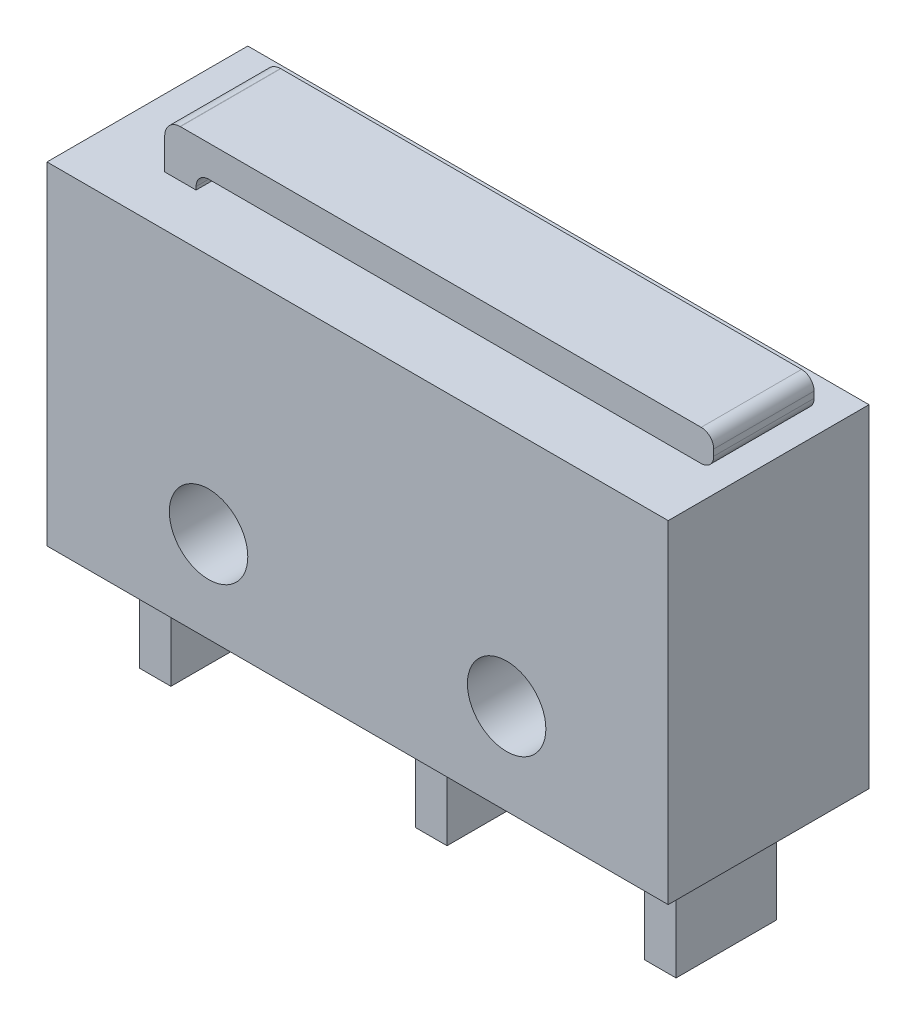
ISO-10303-21;
HEADER;
FILE_DESCRIPTION(('STEP AP214'),'2;1');
FILE_NAME('part.step','',(''),(''),'','','');
FILE_SCHEMA(('AUTOMOTIVE_DESIGN { 1 0 10303 214 1 1 1 1 }'));
ENDSEC;
DATA;
#1=APPLICATION_CONTEXT('core data for automotive mechanical design processes');
#2=APPLICATION_PROTOCOL_DEFINITION('international standard','automotive_design',2000,#1);
#3=PRODUCT_CONTEXT('',#1,'mechanical');
#4=PRODUCT('Part','Part','',(#3));
#5=PRODUCT_RELATED_PRODUCT_CATEGORY('part','',(#4));
#6=PRODUCT_DEFINITION_FORMATION('','',#4);
#7=PRODUCT_DEFINITION_CONTEXT('part definition',#1,'design');
#8=PRODUCT_DEFINITION('design','',#6,#7);
#9=PRODUCT_DEFINITION_SHAPE('','',#8);
#10=(LENGTH_UNIT() NAMED_UNIT(*) SI_UNIT(.MILLI.,.METRE.));
#11=(NAMED_UNIT(*) PLANE_ANGLE_UNIT() SI_UNIT($,.RADIAN.));
#12=(NAMED_UNIT(*) SI_UNIT($,.STERADIAN.) SOLID_ANGLE_UNIT());
#13=UNCERTAINTY_MEASURE_WITH_UNIT(LENGTH_MEASURE(1.E-05),#10,'distance_accuracy_value','');
#14=(GEOMETRIC_REPRESENTATION_CONTEXT(3) GLOBAL_UNCERTAINTY_ASSIGNED_CONTEXT((#13)) GLOBAL_UNIT_ASSIGNED_CONTEXT((#10,
#11,#12)) REPRESENTATION_CONTEXT('',''));
#15=CARTESIAN_POINT('',(0.,0.,0.));
#16=DIRECTION('',(0.,0.,1.));
#17=DIRECTION('',(1.,0.,0.));
#18=AXIS2_PLACEMENT_3D('',#15,#16,#17);
#19=CARTESIAN_POINT('',(-9.9,10.6,-3.2));
#20=DIRECTION('',(0.,0.,1.));
#21=DIRECTION('',(1.,0.,0.));
#22=AXIS2_PLACEMENT_3D('',#19,#20,#21);
#23=PLANE('',#22);
#24=DIRECTION('',(-1.,0.,0.));
#25=VECTOR('',#24,1.);
#26=CARTESIAN_POINT('',(-9.9,0.,-3.2));
#27=LINE('',#26,#25);
#28=CARTESIAN_POINT('',(9.90000000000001,0.,-3.2));
#29=VERTEX_POINT('',#28);
#30=CARTESIAN_POINT('',(-9.9,0.,-3.2));
#31=VERTEX_POINT('',#30);
#32=EDGE_CURVE('E358',#29,#31,#27,.T.);
#33=ORIENTED_EDGE('',*,*,#32,.T.);
#34=DIRECTION('',(0.,-1.,0.));
#35=VECTOR('',#34,1.);
#36=CARTESIAN_POINT('',(-9.9,10.6,-3.2));
#37=LINE('',#36,#35);
#38=CARTESIAN_POINT('',(-9.9,10.6,-3.2));
#39=VERTEX_POINT('',#38);
#40=EDGE_CURVE('E44',#39,#31,#37,.T.);
#41=ORIENTED_EDGE('',*,*,#40,.F.);
#42=DIRECTION('',(-1.,0.,0.));
#43=VECTOR('',#42,1.);
#44=CARTESIAN_POINT('',(-9.9,10.6,-3.2));
#45=LINE('',#44,#43);
#46=CARTESIAN_POINT('',(9.90000000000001,10.6,-3.2));
#47=VERTEX_POINT('',#46);
#48=EDGE_CURVE('E348',#47,#39,#45,.T.);
#49=ORIENTED_EDGE('',*,*,#48,.F.);
#50=DIRECTION('',(0.,-1.,0.));
#51=VECTOR('',#50,1.);
#52=CARTESIAN_POINT('',(9.90000000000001,10.6,-3.2));
#53=LINE('',#52,#51);
#54=EDGE_CURVE('E11',#47,#29,#53,.T.);
#55=ORIENTED_EDGE('',*,*,#54,.T.);
#56=EDGE_LOOP('',(#33,#41,#49,#55));
#57=FACE_BOUND('',#56,.T.);
#58=CARTESIAN_POINT('',(4.75,2.9,-3.2));
#59=DIRECTION('',(0.,0.,1.));
#60=DIRECTION('',(1.,0.,0.));
#61=AXIS2_PLACEMENT_3D('',#58,#59,#60);
#62=CIRCLE('',#61,1.25);
#63=CARTESIAN_POINT('',(6.,2.9,-3.2));
#64=VERTEX_POINT('',#63);
#65=EDGE_CURVE('E241',#64,#64,#62,.F.);
#66=ORIENTED_EDGE('',*,*,#65,.F.);
#67=EDGE_LOOP('',(#66));
#68=FACE_BOUND('',#67,.T.);
#69=CARTESIAN_POINT('',(-4.75,2.9,-3.2));
#70=DIRECTION('',(0.,0.,1.));
#71=DIRECTION('',(1.,0.,0.));
#72=AXIS2_PLACEMENT_3D('',#69,#70,#71);
#73=CIRCLE('',#72,1.25);
#74=CARTESIAN_POINT('',(-3.5,2.9,-3.2));
#75=VERTEX_POINT('',#74);
#76=EDGE_CURVE('E248',#75,#75,#73,.T.);
#77=ORIENTED_EDGE('',*,*,#76,.T.);
#78=EDGE_LOOP('',(#77));
#79=FACE_BOUND('',#78,.T.);
#80=ADVANCED_FACE('F35',(#57,#68,#79),#23,.F.);
#81=CARTESIAN_POINT('',(-9.9,10.6,3.2));
#82=DIRECTION('',(0.,0.,-1.));
#83=DIRECTION('',(-1.,0.,0.));
#84=AXIS2_PLACEMENT_3D('',#81,#82,#83);
#85=PLANE('',#84);
#86=DIRECTION('',(1.,0.,0.));
#87=VECTOR('',#86,1.);
#88=CARTESIAN_POINT('',(-9.9,0.,3.2));
#89=LINE('',#88,#87);
#90=CARTESIAN_POINT('',(-9.9,0.,3.2));
#91=VERTEX_POINT('',#90);
#92=CARTESIAN_POINT('',(9.90000000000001,0.,3.2));
#93=VERTEX_POINT('',#92);
#94=EDGE_CURVE('E349',#91,#93,#89,.T.);
#95=ORIENTED_EDGE('',*,*,#94,.T.);
#96=DIRECTION('',(0.,-1.,0.));
#97=VECTOR('',#96,1.);
#98=CARTESIAN_POINT('',(9.90000000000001,10.6,3.2));
#99=LINE('',#98,#97);
#100=CARTESIAN_POINT('',(9.90000000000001,10.6,3.2));
#101=VERTEX_POINT('',#100);
#102=EDGE_CURVE('E355',#101,#93,#99,.T.);
#103=ORIENTED_EDGE('',*,*,#102,.F.);
#104=DIRECTION('',(1.,0.,0.));
#105=VECTOR('',#104,1.);
#106=CARTESIAN_POINT('',(-9.9,10.6,3.2));
#107=LINE('',#106,#105);
#108=CARTESIAN_POINT('',(-9.9,10.6,3.2));
#109=VERTEX_POINT('',#108);
#110=EDGE_CURVE('E353',#109,#101,#107,.T.);
#111=ORIENTED_EDGE('',*,*,#110,.F.);
#112=DIRECTION('',(0.,-1.,0.));
#113=VECTOR('',#112,1.);
#114=CARTESIAN_POINT('',(-9.9,10.6,3.2));
#115=LINE('',#114,#113);
#116=EDGE_CURVE('E365',#109,#91,#115,.T.);
#117=ORIENTED_EDGE('',*,*,#116,.T.);
#118=EDGE_LOOP('',(#95,#103,#111,#117));
#119=FACE_BOUND('',#118,.T.);
#120=CARTESIAN_POINT('',(4.75,2.9,3.2));
#121=DIRECTION('',(0.,0.,-1.));
#122=DIRECTION('',(-1.,0.,0.));
#123=AXIS2_PLACEMENT_3D('',#120,#121,#122);
#124=CIRCLE('',#123,1.25);
#125=CARTESIAN_POINT('',(3.5,2.9,3.2));
#126=VERTEX_POINT('',#125);
#127=EDGE_CURVE('E238',#126,#126,#124,.F.);
#128=ORIENTED_EDGE('',*,*,#127,.F.);
#129=EDGE_LOOP('',(#128));
#130=FACE_BOUND('',#129,.T.);
#131=CARTESIAN_POINT('',(-4.75,2.9,3.2));
#132=DIRECTION('',(0.,0.,-1.));
#133=DIRECTION('',(-1.,0.,0.));
#134=AXIS2_PLACEMENT_3D('',#131,#132,#133);
#135=CIRCLE('',#134,1.25);
#136=CARTESIAN_POINT('',(-6.,2.9,3.2));
#137=VERTEX_POINT('',#136);
#138=EDGE_CURVE('E39',#137,#137,#135,.T.);
#139=ORIENTED_EDGE('',*,*,#138,.T.);
#140=EDGE_LOOP('',(#139));
#141=FACE_BOUND('',#140,.T.);
#142=ADVANCED_FACE('F382',(#119,#130,#141),#85,.F.);
#143=CARTESIAN_POINT('',(9.90000000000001,10.6,-3.2));
#144=DIRECTION('',(-1.,0.,0.));
#145=DIRECTION('',(0.,0.,1.));
#146=AXIS2_PLACEMENT_3D('',#143,#144,#145);
#147=PLANE('',#146);
#148=DIRECTION('',(0.,0.,-1.));
#149=VECTOR('',#148,1.);
#150=CARTESIAN_POINT('',(9.90000000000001,0.,-3.2));
#151=LINE('',#150,#149);
#152=EDGE_CURVE('E344',#93,#29,#151,.T.);
#153=ORIENTED_EDGE('',*,*,#152,.T.);
#154=ORIENTED_EDGE('',*,*,#54,.F.);
#155=DIRECTION('',(0.,0.,-1.));
#156=VECTOR('',#155,1.);
#157=CARTESIAN_POINT('',(9.90000000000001,10.6,-3.2));
#158=LINE('',#157,#156);
#159=EDGE_CURVE('E345',#101,#47,#158,.T.);
#160=ORIENTED_EDGE('',*,*,#159,.F.);
#161=ORIENTED_EDGE('',*,*,#102,.T.);
#162=EDGE_LOOP('',(#153,#154,#160,#161));
#163=FACE_BOUND('',#162,.T.);
#164=ADVANCED_FACE('F37',(#163),#147,.F.);
#165=CARTESIAN_POINT('',(-9.9,10.6,-3.2));
#166=DIRECTION('',(1.,0.,0.));
#167=DIRECTION('',(0.,0.,-1.));
#168=AXIS2_PLACEMENT_3D('',#165,#166,#167);
#169=PLANE('',#168);
#170=DIRECTION('',(0.,0.,1.));
#171=VECTOR('',#170,1.);
#172=CARTESIAN_POINT('',(-9.9,0.,-3.2));
#173=LINE('',#172,#171);
#174=EDGE_CURVE('E360',#31,#91,#173,.T.);
#175=ORIENTED_EDGE('',*,*,#174,.T.);
#176=ORIENTED_EDGE('',*,*,#116,.F.);
#177=DIRECTION('',(0.,0.,1.));
#178=VECTOR('',#177,1.);
#179=CARTESIAN_POINT('',(-9.9,10.6,-3.2));
#180=LINE('',#179,#178);
#181=EDGE_CURVE('E351',#39,#109,#180,.T.);
#182=ORIENTED_EDGE('',*,*,#181,.F.);
#183=ORIENTED_EDGE('',*,*,#40,.T.);
#184=EDGE_LOOP('',(#175,#176,#182,#183));
#185=FACE_BOUND('',#184,.T.);
#186=ADVANCED_FACE('F373',(#185),#169,.F.);
#187=CARTESIAN_POINT('',(0.,10.6,0.));
#188=DIRECTION('',(0.,1.,0.));
#189=DIRECTION('',(0.,0.,1.));
#190=AXIS2_PLACEMENT_3D('',#187,#188,#189);
#191=PLANE('',#190);
#192=DIRECTION('',(1.,0.,0.));
#193=VECTOR('',#192,1.);
#194=CARTESIAN_POINT('',(-7.7472823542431,10.6,1.6));
#195=LINE('',#194,#193);
#196=CARTESIAN_POINT('',(-7.7472823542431,10.6,1.6));
#197=VERTEX_POINT('',#196);
#198=CARTESIAN_POINT('',(-6.7472823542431,10.6,1.6));
#199=VERTEX_POINT('',#198);
#200=EDGE_CURVE('E222',#197,#199,#195,.T.);
#201=ORIENTED_EDGE('',*,*,#200,.F.);
#202=DIRECTION('',(0.,0.,-1.));
#203=VECTOR('',#202,1.);
#204=CARTESIAN_POINT('',(-7.7472823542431,10.6,1.6));
#205=LINE('',#204,#203);
#206=CARTESIAN_POINT('',(-7.7472823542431,10.6,-1.6));
#207=VERTEX_POINT('',#206);
#208=EDGE_CURVE('E723',#197,#207,#205,.T.);
#209=ORIENTED_EDGE('',*,*,#208,.T.);
#210=DIRECTION('',(1.,0.,0.));
#211=VECTOR('',#210,1.);
#212=CARTESIAN_POINT('',(-7.7472823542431,10.6,-1.6));
#213=LINE('',#212,#211);
#214=CARTESIAN_POINT('',(-6.7472823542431,10.6,-1.6));
#215=VERTEX_POINT('',#214);
#216=EDGE_CURVE('E237',#207,#215,#213,.T.);
#217=ORIENTED_EDGE('',*,*,#216,.T.);
#218=DIRECTION('',(0.,0.,-1.));
#219=VECTOR('',#218,1.);
#220=CARTESIAN_POINT('',(-6.7472823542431,10.6,1.6));
#221=LINE('',#220,#219);
#222=EDGE_CURVE('E52',#199,#215,#221,.T.);
#223=ORIENTED_EDGE('',*,*,#222,.F.);
#224=EDGE_LOOP('',(#201,#209,#217,#223));
#225=FACE_BOUND('',#224,.T.);
#226=ORIENTED_EDGE('',*,*,#159,.T.);
#227=ORIENTED_EDGE('',*,*,#48,.T.);
#228=ORIENTED_EDGE('',*,*,#181,.T.);
#229=ORIENTED_EDGE('',*,*,#110,.T.);
#230=EDGE_LOOP('',(#226,#227,#228,#229));
#231=FACE_BOUND('',#230,.T.);
#232=ADVANCED_FACE('F234',(#225,#231),#191,.T.);
#233=CARTESIAN_POINT('',(0.,0.,0.));
#234=DIRECTION('',(0.,1.,0.));
#235=DIRECTION('',(0.,0.,1.));
#236=AXIS2_PLACEMENT_3D('',#233,#234,#235);
#237=PLANE('',#236);
#238=DIRECTION('',(0.,0.,-1.));
#239=VECTOR('',#238,1.);
#240=CARTESIAN_POINT('',(7.55,0.,1.6));
#241=LINE('',#240,#239);
#242=CARTESIAN_POINT('',(7.55,0.,1.6));
#243=VERTEX_POINT('',#242);
#244=CARTESIAN_POINT('',(7.55,0.,-1.6));
#245=VERTEX_POINT('',#244);
#246=EDGE_CURVE('E60',#243,#245,#241,.T.);
#247=ORIENTED_EDGE('',*,*,#246,.F.);
#248=DIRECTION('',(-1.,0.,0.));
#249=VECTOR('',#248,1.);
#250=CARTESIAN_POINT('',(7.55,0.,1.6));
#251=LINE('',#250,#249);
#252=CARTESIAN_POINT('',(8.55,0.,1.6));
#253=VERTEX_POINT('',#252);
#254=EDGE_CURVE('E261',#253,#243,#251,.T.);
#255=ORIENTED_EDGE('',*,*,#254,.F.);
#256=DIRECTION('',(0.,0.,-1.));
#257=VECTOR('',#256,1.);
#258=CARTESIAN_POINT('',(8.55,0.,1.6));
#259=LINE('',#258,#257);
#260=CARTESIAN_POINT('',(8.55,0.,-1.6));
#261=VERTEX_POINT('',#260);
#262=EDGE_CURVE('E272',#253,#261,#259,.T.);
#263=ORIENTED_EDGE('',*,*,#262,.T.);
#264=DIRECTION('',(-1.,0.,0.));
#265=VECTOR('',#264,1.);
#266=CARTESIAN_POINT('',(7.55,0.,-1.6));
#267=LINE('',#266,#265);
#268=EDGE_CURVE('E256',#261,#245,#267,.T.);
#269=ORIENTED_EDGE('',*,*,#268,.T.);
#270=EDGE_LOOP('',(#247,#255,#263,#269));
#271=FACE_BOUND('',#270,.T.);
#272=DIRECTION('',(0.,0.,-1.));
#273=VECTOR('',#272,1.);
#274=CARTESIAN_POINT('',(0.250000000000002,0.,1.6));
#275=LINE('',#274,#273);
#276=CARTESIAN_POINT('',(0.250000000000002,0.,1.6));
#277=VERTEX_POINT('',#276);
#278=CARTESIAN_POINT('',(0.250000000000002,0.,-1.6));
#279=VERTEX_POINT('',#278);
#280=EDGE_CURVE('E293',#277,#279,#275,.T.);
#281=ORIENTED_EDGE('',*,*,#280,.F.);
#282=DIRECTION('',(-1.,0.,0.));
#283=VECTOR('',#282,1.);
#284=CARTESIAN_POINT('',(0.250000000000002,0.,1.6));
#285=LINE('',#284,#283);
#286=CARTESIAN_POINT('',(1.25,0.,1.6));
#287=VERTEX_POINT('',#286);
#288=EDGE_CURVE('E290',#287,#277,#285,.T.);
#289=ORIENTED_EDGE('',*,*,#288,.F.);
#290=DIRECTION('',(0.,0.,-1.));
#291=VECTOR('',#290,1.);
#292=CARTESIAN_POINT('',(1.25,0.,1.6));
#293=LINE('',#292,#291);
#294=CARTESIAN_POINT('',(1.25,0.,-1.6));
#295=VERTEX_POINT('',#294);
#296=EDGE_CURVE('E304',#287,#295,#293,.T.);
#297=ORIENTED_EDGE('',*,*,#296,.T.);
#298=DIRECTION('',(-1.,0.,0.));
#299=VECTOR('',#298,1.);
#300=CARTESIAN_POINT('',(0.250000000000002,0.,-1.6));
#301=LINE('',#300,#299);
#302=EDGE_CURVE('E285',#295,#279,#301,.T.);
#303=ORIENTED_EDGE('',*,*,#302,.T.);
#304=EDGE_LOOP('',(#281,#289,#297,#303));
#305=FACE_BOUND('',#304,.T.);
#306=DIRECTION('',(0.,0.,-1.));
#307=VECTOR('',#306,1.);
#308=CARTESIAN_POINT('',(-8.55,0.,1.6));
#309=LINE('',#308,#307);
#310=CARTESIAN_POINT('',(-8.55,0.,1.6));
#311=VERTEX_POINT('',#310);
#312=CARTESIAN_POINT('',(-8.55,0.,-1.6));
#313=VERTEX_POINT('',#312);
#314=EDGE_CURVE('E325',#311,#313,#309,.T.);
#315=ORIENTED_EDGE('',*,*,#314,.F.);
#316=DIRECTION('',(-1.,0.,0.));
#317=VECTOR('',#316,1.);
#318=CARTESIAN_POINT('',(-8.55,0.,1.6));
#319=LINE('',#318,#317);
#320=CARTESIAN_POINT('',(-7.55,0.,1.6));
#321=VERTEX_POINT('',#320);
#322=EDGE_CURVE('E322',#321,#311,#319,.T.);
#323=ORIENTED_EDGE('',*,*,#322,.F.);
#324=DIRECTION('',(0.,0.,-1.));
#325=VECTOR('',#324,1.);
#326=CARTESIAN_POINT('',(-7.55,0.,1.6));
#327=LINE('',#326,#325);
#328=CARTESIAN_POINT('',(-7.55,0.,-1.6));
#329=VERTEX_POINT('',#328);
#330=EDGE_CURVE('E336',#321,#329,#327,.T.);
#331=ORIENTED_EDGE('',*,*,#330,.T.);
#332=DIRECTION('',(-1.,0.,0.));
#333=VECTOR('',#332,1.);
#334=CARTESIAN_POINT('',(-8.55,0.,-1.6));
#335=LINE('',#334,#333);
#336=EDGE_CURVE('E317',#329,#313,#335,.T.);
#337=ORIENTED_EDGE('',*,*,#336,.T.);
#338=EDGE_LOOP('',(#315,#323,#331,#337));
#339=FACE_BOUND('',#338,.T.);
#340=ORIENTED_EDGE('',*,*,#152,.F.);
#341=ORIENTED_EDGE('',*,*,#94,.F.);
#342=ORIENTED_EDGE('',*,*,#174,.F.);
#343=ORIENTED_EDGE('',*,*,#32,.F.);
#344=EDGE_LOOP('',(#340,#341,#342,#343));
#345=FACE_BOUND('',#344,.T.);
#346=ADVANCED_FACE('F379',(#271,#305,#339,#345),#237,.F.);
#347=CARTESIAN_POINT('',(-8.55,0.,1.6));
#348=DIRECTION('',(1.,0.,0.));
#349=DIRECTION('',(0.,0.,-1.));
#350=AXIS2_PLACEMENT_3D('',#347,#348,#349);
#351=PLANE('',#350);
#352=DIRECTION('',(0.,-1.,0.));
#353=VECTOR('',#352,1.);
#354=CARTESIAN_POINT('',(-8.55,0.,-1.6));
#355=LINE('',#354,#353);
#356=CARTESIAN_POINT('',(-8.55,-3.5,-1.6));
#357=VERTEX_POINT('',#356);
#358=EDGE_CURVE('E312',#313,#357,#355,.T.);
#359=ORIENTED_EDGE('',*,*,#358,.T.);
#360=DIRECTION('',(0.,0.,-1.));
#361=VECTOR('',#360,1.);
#362=CARTESIAN_POINT('',(-8.55,-3.5,1.6));
#363=LINE('',#362,#361);
#364=CARTESIAN_POINT('',(-8.55,-3.5,1.6));
#365=VERTEX_POINT('',#364);
#366=EDGE_CURVE('E341',#365,#357,#363,.T.);
#367=ORIENTED_EDGE('',*,*,#366,.F.);
#368=DIRECTION('',(0.,-1.,0.));
#369=VECTOR('',#368,1.);
#370=CARTESIAN_POINT('',(-8.55,0.,1.6));
#371=LINE('',#370,#369);
#372=EDGE_CURVE('E313',#311,#365,#371,.T.);
#373=ORIENTED_EDGE('',*,*,#372,.F.);
#374=ORIENTED_EDGE('',*,*,#314,.T.);
#375=EDGE_LOOP('',(#359,#367,#373,#374));
#376=FACE_BOUND('',#375,.T.);
#377=ADVANCED_FACE('F465',(#376),#351,.F.);
#378=CARTESIAN_POINT('',(-8.55,-3.5,1.6));
#379=DIRECTION('',(0.,1.,0.));
#380=DIRECTION('',(0.,0.,1.));
#381=AXIS2_PLACEMENT_3D('',#378,#379,#380);
#382=PLANE('',#381);
#383=DIRECTION('',(1.,0.,0.));
#384=VECTOR('',#383,1.);
#385=CARTESIAN_POINT('',(-8.55,-3.5,-1.6));
#386=LINE('',#385,#384);
#387=CARTESIAN_POINT('',(-7.55,-3.5,-1.6));
#388=VERTEX_POINT('',#387);
#389=EDGE_CURVE('E328',#357,#388,#386,.T.);
#390=ORIENTED_EDGE('',*,*,#389,.T.);
#391=DIRECTION('',(0.,0.,-1.));
#392=VECTOR('',#391,1.);
#393=CARTESIAN_POINT('',(-7.55,-3.5,1.6));
#394=LINE('',#393,#392);
#395=CARTESIAN_POINT('',(-7.55,-3.5,1.6));
#396=VERTEX_POINT('',#395);
#397=EDGE_CURVE('E338',#396,#388,#394,.T.);
#398=ORIENTED_EDGE('',*,*,#397,.F.);
#399=DIRECTION('',(1.,0.,0.));
#400=VECTOR('',#399,1.);
#401=CARTESIAN_POINT('',(-8.55,-3.5,1.6));
#402=LINE('',#401,#400);
#403=EDGE_CURVE('E316',#365,#396,#402,.T.);
#404=ORIENTED_EDGE('',*,*,#403,.F.);
#405=ORIENTED_EDGE('',*,*,#366,.T.);
#406=EDGE_LOOP('',(#390,#398,#404,#405));
#407=FACE_BOUND('',#406,.T.);
#408=ADVANCED_FACE('F461',(#407),#382,.F.);
#409=CARTESIAN_POINT('',(-7.55,0.,1.6));
#410=DIRECTION('',(-1.,0.,0.));
#411=DIRECTION('',(0.,0.,1.));
#412=AXIS2_PLACEMENT_3D('',#409,#410,#411);
#413=PLANE('',#412);
#414=DIRECTION('',(0.,1.,0.));
#415=VECTOR('',#414,1.);
#416=CARTESIAN_POINT('',(-7.55,0.,-1.6));
#417=LINE('',#416,#415);
#418=EDGE_CURVE('E330',#388,#329,#417,.T.);
#419=ORIENTED_EDGE('',*,*,#418,.T.);
#420=ORIENTED_EDGE('',*,*,#330,.F.);
#421=DIRECTION('',(0.,1.,0.));
#422=VECTOR('',#421,1.);
#423=CARTESIAN_POINT('',(-7.55,0.,1.6));
#424=LINE('',#423,#422);
#425=EDGE_CURVE('E319',#396,#321,#424,.T.);
#426=ORIENTED_EDGE('',*,*,#425,.F.);
#427=ORIENTED_EDGE('',*,*,#397,.T.);
#428=EDGE_LOOP('',(#419,#420,#426,#427));
#429=FACE_BOUND('',#428,.T.);
#430=ADVANCED_FACE('F454',(#429),#413,.F.);
#431=CARTESIAN_POINT('',(0.,0.,1.6));
#432=DIRECTION('',(0.,0.,1.));
#433=DIRECTION('',(1.,0.,0.));
#434=AXIS2_PLACEMENT_3D('',#431,#432,#433);
#435=PLANE('',#434);
#436=ORIENTED_EDGE('',*,*,#372,.T.);
#437=ORIENTED_EDGE('',*,*,#403,.T.);
#438=ORIENTED_EDGE('',*,*,#425,.T.);
#439=ORIENTED_EDGE('',*,*,#322,.T.);
#440=EDGE_LOOP('',(#436,#437,#438,#439));
#441=FACE_BOUND('',#440,.T.);
#442=ADVANCED_FACE('F451',(#441),#435,.T.);
#443=CARTESIAN_POINT('',(0.,0.,-1.6));
#444=DIRECTION('',(0.,0.,1.));
#445=DIRECTION('',(1.,0.,0.));
#446=AXIS2_PLACEMENT_3D('',#443,#444,#445);
#447=PLANE('',#446);
#448=ORIENTED_EDGE('',*,*,#358,.F.);
#449=ORIENTED_EDGE('',*,*,#336,.F.);
#450=ORIENTED_EDGE('',*,*,#418,.F.);
#451=ORIENTED_EDGE('',*,*,#389,.F.);
#452=EDGE_LOOP('',(#448,#449,#450,#451));
#453=FACE_BOUND('',#452,.T.);
#454=ADVANCED_FACE('F449',(#453),#447,.F.);
#455=CARTESIAN_POINT('',(0.250000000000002,0.,1.6));
#456=DIRECTION('',(1.,0.,0.));
#457=DIRECTION('',(0.,0.,-1.));
#458=AXIS2_PLACEMENT_3D('',#455,#456,#457);
#459=PLANE('',#458);
#460=DIRECTION('',(0.,-1.,0.));
#461=VECTOR('',#460,1.);
#462=CARTESIAN_POINT('',(0.250000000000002,0.,-1.6));
#463=LINE('',#462,#461);
#464=CARTESIAN_POINT('',(0.250000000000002,-3.5,-1.6));
#465=VERTEX_POINT('',#464);
#466=EDGE_CURVE('E280',#279,#465,#463,.T.);
#467=ORIENTED_EDGE('',*,*,#466,.T.);
#468=DIRECTION('',(0.,0.,-1.));
#469=VECTOR('',#468,1.);
#470=CARTESIAN_POINT('',(0.250000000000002,-3.5,1.6));
#471=LINE('',#470,#469);
#472=CARTESIAN_POINT('',(0.250000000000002,-3.5,1.6));
#473=VERTEX_POINT('',#472);
#474=EDGE_CURVE('E309',#473,#465,#471,.T.);
#475=ORIENTED_EDGE('',*,*,#474,.F.);
#476=DIRECTION('',(0.,-1.,0.));
#477=VECTOR('',#476,1.);
#478=CARTESIAN_POINT('',(0.250000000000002,0.,1.6));
#479=LINE('',#478,#477);
#480=EDGE_CURVE('E281',#277,#473,#479,.T.);
#481=ORIENTED_EDGE('',*,*,#480,.F.);
#482=ORIENTED_EDGE('',*,*,#280,.T.);
#483=EDGE_LOOP('',(#467,#475,#481,#482));
#484=FACE_BOUND('',#483,.T.);
#485=ADVANCED_FACE('F445',(#484),#459,.F.);
#486=CARTESIAN_POINT('',(0.250000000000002,-3.5,1.6));
#487=DIRECTION('',(0.,1.,0.));
#488=DIRECTION('',(0.,0.,1.));
#489=AXIS2_PLACEMENT_3D('',#486,#487,#488);
#490=PLANE('',#489);
#491=DIRECTION('',(1.,0.,0.));
#492=VECTOR('',#491,1.);
#493=CARTESIAN_POINT('',(0.250000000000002,-3.5,-1.6));
#494=LINE('',#493,#492);
#495=CARTESIAN_POINT('',(1.25,-3.5,-1.6));
#496=VERTEX_POINT('',#495);
#497=EDGE_CURVE('E296',#465,#496,#494,.T.);
#498=ORIENTED_EDGE('',*,*,#497,.T.);
#499=DIRECTION('',(0.,0.,-1.));
#500=VECTOR('',#499,1.);
#501=CARTESIAN_POINT('',(1.25,-3.5,1.6));
#502=LINE('',#501,#500);
#503=CARTESIAN_POINT('',(1.25,-3.5,1.6));
#504=VERTEX_POINT('',#503);
#505=EDGE_CURVE('E306',#504,#496,#502,.T.);
#506=ORIENTED_EDGE('',*,*,#505,.F.);
#507=DIRECTION('',(1.,0.,0.));
#508=VECTOR('',#507,1.);
#509=CARTESIAN_POINT('',(0.250000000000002,-3.5,1.6));
#510=LINE('',#509,#508);
#511=EDGE_CURVE('E284',#473,#504,#510,.T.);
#512=ORIENTED_EDGE('',*,*,#511,.F.);
#513=ORIENTED_EDGE('',*,*,#474,.T.);
#514=EDGE_LOOP('',(#498,#506,#512,#513));
#515=FACE_BOUND('',#514,.T.);
#516=ADVANCED_FACE('F441',(#515),#490,.F.);
#517=CARTESIAN_POINT('',(1.25,0.,1.6));
#518=DIRECTION('',(-1.,0.,0.));
#519=DIRECTION('',(0.,0.,1.));
#520=AXIS2_PLACEMENT_3D('',#517,#518,#519);
#521=PLANE('',#520);
#522=DIRECTION('',(0.,1.,0.));
#523=VECTOR('',#522,1.);
#524=CARTESIAN_POINT('',(1.25,0.,-1.6));
#525=LINE('',#524,#523);
#526=EDGE_CURVE('E298',#496,#295,#525,.T.);
#527=ORIENTED_EDGE('',*,*,#526,.T.);
#528=ORIENTED_EDGE('',*,*,#296,.F.);
#529=DIRECTION('',(0.,1.,0.));
#530=VECTOR('',#529,1.);
#531=CARTESIAN_POINT('',(1.25,0.,1.6));
#532=LINE('',#531,#530);
#533=EDGE_CURVE('E287',#504,#287,#532,.T.);
#534=ORIENTED_EDGE('',*,*,#533,.F.);
#535=ORIENTED_EDGE('',*,*,#505,.T.);
#536=EDGE_LOOP('',(#527,#528,#534,#535));
#537=FACE_BOUND('',#536,.T.);
#538=ADVANCED_FACE('F434',(#537),#521,.F.);
#539=CARTESIAN_POINT('',(0.,0.,1.6));
#540=DIRECTION('',(0.,0.,1.));
#541=DIRECTION('',(1.,0.,0.));
#542=AXIS2_PLACEMENT_3D('',#539,#540,#541);
#543=PLANE('',#542);
#544=ORIENTED_EDGE('',*,*,#480,.T.);
#545=ORIENTED_EDGE('',*,*,#511,.T.);
#546=ORIENTED_EDGE('',*,*,#533,.T.);
#547=ORIENTED_EDGE('',*,*,#288,.T.);
#548=EDGE_LOOP('',(#544,#545,#546,#547));
#549=FACE_BOUND('',#548,.T.);
#550=ADVANCED_FACE('F431',(#549),#543,.T.);
#551=CARTESIAN_POINT('',(0.,0.,-1.6));
#552=DIRECTION('',(0.,0.,1.));
#553=DIRECTION('',(1.,0.,0.));
#554=AXIS2_PLACEMENT_3D('',#551,#552,#553);
#555=PLANE('',#554);
#556=ORIENTED_EDGE('',*,*,#466,.F.);
#557=ORIENTED_EDGE('',*,*,#302,.F.);
#558=ORIENTED_EDGE('',*,*,#526,.F.);
#559=ORIENTED_EDGE('',*,*,#497,.F.);
#560=EDGE_LOOP('',(#556,#557,#558,#559));
#561=FACE_BOUND('',#560,.T.);
#562=ADVANCED_FACE('F429',(#561),#555,.F.);
#563=CARTESIAN_POINT('',(7.55,0.,1.6));
#564=DIRECTION('',(1.,0.,0.));
#565=DIRECTION('',(0.,0.,-1.));
#566=AXIS2_PLACEMENT_3D('',#563,#564,#565);
#567=PLANE('',#566);
#568=DIRECTION('',(0.,-1.,0.));
#569=VECTOR('',#568,1.);
#570=CARTESIAN_POINT('',(7.55,0.,-1.6));
#571=LINE('',#570,#569);
#572=CARTESIAN_POINT('',(7.55,-3.5,-1.6));
#573=VERTEX_POINT('',#572);
#574=EDGE_CURVE('E251',#245,#573,#571,.T.);
#575=ORIENTED_EDGE('',*,*,#574,.T.);
#576=DIRECTION('',(0.,0.,-1.));
#577=VECTOR('',#576,1.);
#578=CARTESIAN_POINT('',(7.55,-3.5,1.6));
#579=LINE('',#578,#577);
#580=CARTESIAN_POINT('',(7.55,-3.5,1.6));
#581=VERTEX_POINT('',#580);
#582=EDGE_CURVE('E277',#581,#573,#579,.T.);
#583=ORIENTED_EDGE('',*,*,#582,.F.);
#584=DIRECTION('',(0.,-1.,0.));
#585=VECTOR('',#584,1.);
#586=CARTESIAN_POINT('',(7.55,0.,1.6));
#587=LINE('',#586,#585);
#588=EDGE_CURVE('E252',#243,#581,#587,.T.);
#589=ORIENTED_EDGE('',*,*,#588,.F.);
#590=ORIENTED_EDGE('',*,*,#246,.T.);
#591=EDGE_LOOP('',(#575,#583,#589,#590));
#592=FACE_BOUND('',#591,.T.);
#593=ADVANCED_FACE('F425',(#592),#567,.F.);
#594=CARTESIAN_POINT('',(7.55,-3.5,1.6));
#595=DIRECTION('',(0.,1.,0.));
#596=DIRECTION('',(0.,0.,1.));
#597=AXIS2_PLACEMENT_3D('',#594,#595,#596);
#598=PLANE('',#597);
#599=DIRECTION('',(1.,0.,0.));
#600=VECTOR('',#599,1.);
#601=CARTESIAN_POINT('',(7.55,-3.5,-1.6));
#602=LINE('',#601,#600);
#603=CARTESIAN_POINT('',(8.55,-3.5,-1.6));
#604=VERTEX_POINT('',#603);
#605=EDGE_CURVE('E265',#573,#604,#602,.T.);
#606=ORIENTED_EDGE('',*,*,#605,.T.);
#607=DIRECTION('',(0.,0.,-1.));
#608=VECTOR('',#607,1.);
#609=CARTESIAN_POINT('',(8.55,-3.5,1.6));
#610=LINE('',#609,#608);
#611=CARTESIAN_POINT('',(8.55,-3.5,1.6));
#612=VERTEX_POINT('',#611);
#613=EDGE_CURVE('E274',#612,#604,#610,.T.);
#614=ORIENTED_EDGE('',*,*,#613,.F.);
#615=DIRECTION('',(1.,0.,0.));
#616=VECTOR('',#615,1.);
#617=CARTESIAN_POINT('',(7.55,-3.5,1.6));
#618=LINE('',#617,#616);
#619=EDGE_CURVE('E255',#581,#612,#618,.T.);
#620=ORIENTED_EDGE('',*,*,#619,.F.);
#621=ORIENTED_EDGE('',*,*,#582,.T.);
#622=EDGE_LOOP('',(#606,#614,#620,#621));
#623=FACE_BOUND('',#622,.T.);
#624=ADVANCED_FACE('F421',(#623),#598,.F.);
#625=CARTESIAN_POINT('',(8.55,0.,1.6));
#626=DIRECTION('',(-1.,0.,0.));
#627=DIRECTION('',(0.,0.,1.));
#628=AXIS2_PLACEMENT_3D('',#625,#626,#627);
#629=PLANE('',#628);
#630=DIRECTION('',(0.,1.,0.));
#631=VECTOR('',#630,1.);
#632=CARTESIAN_POINT('',(8.55,0.,-1.6));
#633=LINE('',#632,#631);
#634=EDGE_CURVE('E267',#604,#261,#633,.T.);
#635=ORIENTED_EDGE('',*,*,#634,.T.);
#636=ORIENTED_EDGE('',*,*,#262,.F.);
#637=DIRECTION('',(0.,1.,0.));
#638=VECTOR('',#637,1.);
#639=CARTESIAN_POINT('',(8.55,0.,1.6));
#640=LINE('',#639,#638);
#641=EDGE_CURVE('E258',#612,#253,#640,.T.);
#642=ORIENTED_EDGE('',*,*,#641,.F.);
#643=ORIENTED_EDGE('',*,*,#613,.T.);
#644=EDGE_LOOP('',(#635,#636,#642,#643));
#645=FACE_BOUND('',#644,.T.);
#646=ADVANCED_FACE('F414',(#645),#629,.F.);
#647=CARTESIAN_POINT('',(0.,0.,1.6));
#648=DIRECTION('',(0.,0.,1.));
#649=DIRECTION('',(1.,0.,0.));
#650=AXIS2_PLACEMENT_3D('',#647,#648,#649);
#651=PLANE('',#650);
#652=ORIENTED_EDGE('',*,*,#588,.T.);
#653=ORIENTED_EDGE('',*,*,#619,.T.);
#654=ORIENTED_EDGE('',*,*,#641,.T.);
#655=ORIENTED_EDGE('',*,*,#254,.T.);
#656=EDGE_LOOP('',(#652,#653,#654,#655));
#657=FACE_BOUND('',#656,.T.);
#658=ADVANCED_FACE('F411',(#657),#651,.T.);
#659=CARTESIAN_POINT('',(0.,0.,-1.6));
#660=DIRECTION('',(0.,0.,1.));
#661=DIRECTION('',(1.,0.,0.));
#662=AXIS2_PLACEMENT_3D('',#659,#660,#661);
#663=PLANE('',#662);
#664=ORIENTED_EDGE('',*,*,#574,.F.);
#665=ORIENTED_EDGE('',*,*,#268,.F.);
#666=ORIENTED_EDGE('',*,*,#634,.F.);
#667=ORIENTED_EDGE('',*,*,#605,.F.);
#668=EDGE_LOOP('',(#664,#665,#666,#667));
#669=FACE_BOUND('',#668,.T.);
#670=ADVANCED_FACE('F405',(#669),#663,.F.);
#671=CARTESIAN_POINT('',(4.75,2.9,-5.));
#672=DIRECTION('',(0.,0.,1.));
#673=DIRECTION('',(1.,0.,0.));
#674=AXIS2_PLACEMENT_3D('',#671,#672,#673);
#675=CYLINDRICAL_SURFACE('',#674,1.25);
#676=ORIENTED_EDGE('',*,*,#127,.T.);
#677=EDGE_LOOP('',(#676));
#678=FACE_BOUND('',#677,.T.);
#679=ORIENTED_EDGE('',*,*,#65,.T.);
#680=EDGE_LOOP('',(#679));
#681=FACE_BOUND('',#680,.T.);
#682=ADVANCED_FACE('F396',(#678,#681),#675,.F.);
#683=CARTESIAN_POINT('',(-4.75,2.9,-5.));
#684=DIRECTION('',(0.,0.,1.));
#685=DIRECTION('',(1.,0.,0.));
#686=AXIS2_PLACEMENT_3D('',#683,#684,#685);
#687=CYLINDRICAL_SURFACE('',#686,1.25);
#688=ORIENTED_EDGE('',*,*,#138,.F.);
#689=EDGE_LOOP('',(#688));
#690=FACE_BOUND('',#689,.T.);
#691=ORIENTED_EDGE('',*,*,#76,.F.);
#692=EDGE_LOOP('',(#691));
#693=FACE_BOUND('',#692,.T.);
#694=ADVANCED_FACE('F394',(#690,#693),#687,.F.);
#695=CARTESIAN_POINT('',(-6.7472823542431,10.6,1.6));
#696=DIRECTION('',(-1.,0.,0.));
#697=DIRECTION('',(0.,0.,1.));
#698=AXIS2_PLACEMENT_3D('',#695,#696,#697);
#699=PLANE('',#698);
#700=DIRECTION('',(0.,1.,0.));
#701=VECTOR('',#700,1.);
#702=CARTESIAN_POINT('',(-6.7472823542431,10.6,-1.6));
#703=LINE('',#702,#701);
#704=CARTESIAN_POINT('',(-6.7472823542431,10.7,-1.6));
#705=VERTEX_POINT('',#704);
#706=EDGE_CURVE('E721',#215,#705,#703,.T.);
#707=ORIENTED_EDGE('',*,*,#706,.T.);
#708=DIRECTION('',(0.,0.,-1.));
#709=VECTOR('',#708,1.);
#710=CARTESIAN_POINT('',(-6.7472823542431,10.7,1.6));
#711=LINE('',#710,#709);
#712=CARTESIAN_POINT('',(-6.7472823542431,10.7,1.6));
#713=VERTEX_POINT('',#712);
#714=EDGE_CURVE('E218',#713,#705,#711,.T.);
#715=ORIENTED_EDGE('',*,*,#714,.F.);
#716=DIRECTION('',(0.,1.,0.));
#717=VECTOR('',#716,1.);
#718=CARTESIAN_POINT('',(-6.7472823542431,10.6,1.6));
#719=LINE('',#718,#717);
#720=EDGE_CURVE('E214',#199,#713,#719,.T.);
#721=ORIENTED_EDGE('',*,*,#720,.F.);
#722=ORIENTED_EDGE('',*,*,#222,.T.);
#723=EDGE_LOOP('',(#707,#715,#721,#722));
#724=FACE_BOUND('',#723,.T.);
#725=ADVANCED_FACE('F216',(#724),#699,.F.);
#726=CARTESIAN_POINT('',(-6.3472823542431,10.7,1.6));
#727=DIRECTION('',(0.,0.,-1.));
#728=DIRECTION('',(-1.,0.,0.));
#729=AXIS2_PLACEMENT_3D('',#726,#727,#728);
#730=CYLINDRICAL_SURFACE('',#729,0.4);
#731=CARTESIAN_POINT('',(-6.3472823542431,10.7,-1.6));
#732=DIRECTION('',(0.,0.,-1.));
#733=DIRECTION('',(1.,0.,0.));
#734=AXIS2_PLACEMENT_3D('',#731,#732,#733);
#735=CIRCLE('',#734,0.4);
#736=CARTESIAN_POINT('',(-6.3472823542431,11.1,-1.6));
#737=VERTEX_POINT('',#736);
#738=EDGE_CURVE('E758',#705,#737,#735,.T.);
#739=ORIENTED_EDGE('',*,*,#738,.T.);
#740=DIRECTION('',(0.,0.,-1.));
#741=VECTOR('',#740,1.);
#742=CARTESIAN_POINT('',(-6.3472823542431,11.1,1.6));
#743=LINE('',#742,#741);
#744=CARTESIAN_POINT('',(-6.3472823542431,11.1,1.6));
#745=VERTEX_POINT('',#744);
#746=EDGE_CURVE('E242',#745,#737,#743,.T.);
#747=ORIENTED_EDGE('',*,*,#746,.F.);
#748=CARTESIAN_POINT('',(-6.3472823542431,10.7,1.6));
#749=DIRECTION('',(0.,0.,-1.));
#750=DIRECTION('',(1.,0.,0.));
#751=AXIS2_PLACEMENT_3D('',#748,#749,#750);
#752=CIRCLE('',#751,0.4);
#753=EDGE_CURVE('E221',#713,#745,#752,.T.);
#754=ORIENTED_EDGE('',*,*,#753,.F.);
#755=ORIENTED_EDGE('',*,*,#714,.T.);
#756=EDGE_LOOP('',(#739,#747,#754,#755));
#757=FACE_BOUND('',#756,.T.);
#758=ADVANCED_FACE('F403',(#757),#730,.F.);
#759=CARTESIAN_POINT('',(-6.3472823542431,11.1,1.6));
#760=DIRECTION('',(0.,1.,0.));
#761=DIRECTION('',(0.,0.,1.));
#762=AXIS2_PLACEMENT_3D('',#759,#760,#761);
#763=PLANE('',#762);
#764=DIRECTION('',(1.,0.,0.));
#765=VECTOR('',#764,1.);
#766=CARTESIAN_POINT('',(-6.3472823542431,11.1,-1.6));
#767=LINE('',#766,#765);
#768=CARTESIAN_POINT('',(9.35,11.1,-1.6));
#769=VERTEX_POINT('',#768);
#770=EDGE_CURVE('E755',#737,#769,#767,.T.);
#771=ORIENTED_EDGE('',*,*,#770,.T.);
#772=DIRECTION('',(0.,0.,-1.));
#773=VECTOR('',#772,1.);
#774=CARTESIAN_POINT('',(9.35,11.1,1.6));
#775=LINE('',#774,#773);
#776=CARTESIAN_POINT('',(9.35,11.1,1.6));
#777=VERTEX_POINT('',#776);
#778=EDGE_CURVE('E748',#777,#769,#775,.T.);
#779=ORIENTED_EDGE('',*,*,#778,.F.);
#780=DIRECTION('',(1.,0.,0.));
#781=VECTOR('',#780,1.);
#782=CARTESIAN_POINT('',(-6.3472823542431,11.1,1.6));
#783=LINE('',#782,#781);
#784=EDGE_CURVE('E756',#745,#777,#783,.T.);
#785=ORIENTED_EDGE('',*,*,#784,.F.);
#786=ORIENTED_EDGE('',*,*,#746,.T.);
#787=EDGE_LOOP('',(#771,#779,#785,#786));
#788=FACE_BOUND('',#787,.T.);
#789=ADVANCED_FACE('F617',(#788),#763,.F.);
#790=CARTESIAN_POINT('',(9.35,11.5,1.6));
#791=DIRECTION('',(0.,0.,-1.));
#792=DIRECTION('',(-1.,0.,0.));
#793=AXIS2_PLACEMENT_3D('',#790,#791,#792);
#794=CYLINDRICAL_SURFACE('',#793,0.399999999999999);
#795=CARTESIAN_POINT('',(9.35,11.5,-1.6));
#796=DIRECTION('',(0.,0.,1.));
#797=DIRECTION('',(-1.,0.,0.));
#798=AXIS2_PLACEMENT_3D('',#795,#796,#797);
#799=CIRCLE('',#798,0.399999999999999);
#800=CARTESIAN_POINT('',(9.75,11.5,-1.6));
#801=VERTEX_POINT('',#800);
#802=EDGE_CURVE('E760',#769,#801,#799,.T.);
#803=ORIENTED_EDGE('',*,*,#802,.T.);
#804=DIRECTION('',(0.,0.,-1.));
#805=VECTOR('',#804,1.);
#806=CARTESIAN_POINT('',(9.75,11.5,1.6));
#807=LINE('',#806,#805);
#808=CARTESIAN_POINT('',(9.75,11.5,1.6));
#809=VERTEX_POINT('',#808);
#810=EDGE_CURVE('E745',#809,#801,#807,.T.);
#811=ORIENTED_EDGE('',*,*,#810,.F.);
#812=CARTESIAN_POINT('',(9.35,11.5,1.6));
#813=DIRECTION('',(0.,0.,1.));
#814=DIRECTION('',(-1.,0.,0.));
#815=AXIS2_PLACEMENT_3D('',#812,#813,#814);
#816=CIRCLE('',#815,0.399999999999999);
#817=EDGE_CURVE('E783',#777,#809,#816,.T.);
#818=ORIENTED_EDGE('',*,*,#817,.F.);
#819=ORIENTED_EDGE('',*,*,#778,.T.);
#820=EDGE_LOOP('',(#803,#811,#818,#819));
#821=FACE_BOUND('',#820,.T.);
#822=ADVANCED_FACE('F626',(#821),#794,.T.);
#823=CARTESIAN_POINT('',(9.75,11.7,1.6));
#824=DIRECTION('',(-1.,0.,0.));
#825=DIRECTION('',(0.,0.,1.));
#826=AXIS2_PLACEMENT_3D('',#823,#824,#825);
#827=PLANE('',#826);
#828=DIRECTION('',(0.,1.,0.));
#829=VECTOR('',#828,1.);
#830=CARTESIAN_POINT('',(9.75,11.7,-1.6));
#831=LINE('',#830,#829);
#832=CARTESIAN_POINT('',(9.75,11.7,-1.6));
#833=VERTEX_POINT('',#832);
#834=EDGE_CURVE('E762',#801,#833,#831,.T.);
#835=ORIENTED_EDGE('',*,*,#834,.T.);
#836=DIRECTION('',(0.,0.,-1.));
#837=VECTOR('',#836,1.);
#838=CARTESIAN_POINT('',(9.75,11.7,1.6));
#839=LINE('',#838,#837);
#840=CARTESIAN_POINT('',(9.75,11.7,1.6));
#841=VERTEX_POINT('',#840);
#842=EDGE_CURVE('E742',#841,#833,#839,.T.);
#843=ORIENTED_EDGE('',*,*,#842,.F.);
#844=DIRECTION('',(0.,1.,0.));
#845=VECTOR('',#844,1.);
#846=CARTESIAN_POINT('',(9.75,11.7,1.6));
#847=LINE('',#846,#845);
#848=EDGE_CURVE('E787',#809,#841,#847,.T.);
#849=ORIENTED_EDGE('',*,*,#848,.F.);
#850=ORIENTED_EDGE('',*,*,#810,.T.);
#851=EDGE_LOOP('',(#835,#843,#849,#850));
#852=FACE_BOUND('',#851,.T.);
#853=ADVANCED_FACE('F636',(#852),#827,.F.);
#854=CARTESIAN_POINT('',(9.35,11.7,1.6));
#855=DIRECTION('',(0.,0.,-1.));
#856=DIRECTION('',(-1.,0.,0.));
#857=AXIS2_PLACEMENT_3D('',#854,#855,#856);
#858=CYLINDRICAL_SURFACE('',#857,0.399999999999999);
#859=CARTESIAN_POINT('',(9.35,11.7,-1.6));
#860=DIRECTION('',(0.,0.,1.));
#861=DIRECTION('',(-1.,0.,0.));
#862=AXIS2_PLACEMENT_3D('',#859,#860,#861);
#863=CIRCLE('',#862,0.399999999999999);
#864=CARTESIAN_POINT('',(9.35,12.1,-1.6));
#865=VERTEX_POINT('',#864);
#866=EDGE_CURVE('E768',#833,#865,#863,.T.);
#867=ORIENTED_EDGE('',*,*,#866,.T.);
#868=DIRECTION('',(0.,0.,-1.));
#869=VECTOR('',#868,1.);
#870=CARTESIAN_POINT('',(9.35,12.1,1.6));
#871=LINE('',#870,#869);
#872=CARTESIAN_POINT('',(9.35,12.1,1.6));
#873=VERTEX_POINT('',#872);
#874=EDGE_CURVE('E739',#873,#865,#871,.T.);
#875=ORIENTED_EDGE('',*,*,#874,.F.);
#876=CARTESIAN_POINT('',(9.35,11.7,1.6));
#877=DIRECTION('',(0.,0.,1.));
#878=DIRECTION('',(-1.,0.,0.));
#879=AXIS2_PLACEMENT_3D('',#876,#877,#878);
#880=CIRCLE('',#879,0.399999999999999);
#881=EDGE_CURVE('E789',#841,#873,#880,.T.);
#882=ORIENTED_EDGE('',*,*,#881,.F.);
#883=ORIENTED_EDGE('',*,*,#842,.T.);
#884=EDGE_LOOP('',(#867,#875,#882,#883));
#885=FACE_BOUND('',#884,.T.);
#886=ADVANCED_FACE('F646',(#885),#858,.T.);
#887=CARTESIAN_POINT('',(-7.2472823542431,12.1,1.6));
#888=DIRECTION('',(0.,-1.,0.));
#889=DIRECTION('',(0.,0.,-1.));
#890=AXIS2_PLACEMENT_3D('',#887,#888,#889);
#891=PLANE('',#890);
#892=DIRECTION('',(-1.,0.,0.));
#893=VECTOR('',#892,1.);
#894=CARTESIAN_POINT('',(-7.2472823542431,12.1,-1.6));
#895=LINE('',#894,#893);
#896=CARTESIAN_POINT('',(-7.2472823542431,12.1,-1.6));
#897=VERTEX_POINT('',#896);
#898=EDGE_CURVE('E770',#865,#897,#895,.T.);
#899=ORIENTED_EDGE('',*,*,#898,.T.);
#900=DIRECTION('',(0.,0.,-1.));
#901=VECTOR('',#900,1.);
#902=CARTESIAN_POINT('',(-7.2472823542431,12.1,1.6));
#903=LINE('',#902,#901);
#904=CARTESIAN_POINT('',(-7.2472823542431,12.1,1.6));
#905=VERTEX_POINT('',#904);
#906=EDGE_CURVE('E736',#905,#897,#903,.T.);
#907=ORIENTED_EDGE('',*,*,#906,.F.);
#908=DIRECTION('',(-1.,0.,0.));
#909=VECTOR('',#908,1.);
#910=CARTESIAN_POINT('',(-7.2472823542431,12.1,1.6));
#911=LINE('',#910,#909);
#912=EDGE_CURVE('E779',#873,#905,#911,.T.);
#913=ORIENTED_EDGE('',*,*,#912,.F.);
#914=ORIENTED_EDGE('',*,*,#874,.T.);
#915=EDGE_LOOP('',(#899,#907,#913,#914));
#916=FACE_BOUND('',#915,.T.);
#917=ADVANCED_FACE('F656',(#916),#891,.F.);
#918=CARTESIAN_POINT('',(-7.2472823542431,12.1,1.6));
#919=DIRECTION('',(0.0232582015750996,-0.999729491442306,0.));
#920=DIRECTION('',(0.999729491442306,0.0232582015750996,0.));
#921=AXIS2_PLACEMENT_3D('',#918,#919,#920);
#922=PLANE('',#921);
#923=DIRECTION('',(-0.999729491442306,-0.0232582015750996,0.));
#924=VECTOR('',#923,1.);
#925=CARTESIAN_POINT('',(-7.2472823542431,12.1,-1.6));
#926=LINE('',#925,#924);
#927=CARTESIAN_POINT('',(-7.25891145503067,12.099729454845,-1.6));
#928=VERTEX_POINT('',#927);
#929=EDGE_CURVE('E772',#897,#928,#926,.T.);
#930=ORIENTED_EDGE('',*,*,#929,.T.);
#931=DIRECTION('',(0.,0.,-1.));
#932=VECTOR('',#931,1.);
#933=CARTESIAN_POINT('',(-7.25891145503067,12.099729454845,1.6));
#934=LINE('',#933,#932);
#935=CARTESIAN_POINT('',(-7.25891145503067,12.099729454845,1.6));
#936=VERTEX_POINT('',#935);
#937=EDGE_CURVE('E727',#936,#928,#934,.T.);
#938=ORIENTED_EDGE('',*,*,#937,.F.);
#939=DIRECTION('',(-0.999729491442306,-0.0232582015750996,0.));
#940=VECTOR('',#939,1.);
#941=CARTESIAN_POINT('',(-7.2472823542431,12.1,1.6));
#942=LINE('',#941,#940);
#943=EDGE_CURVE('E777',#905,#936,#942,.T.);
#944=ORIENTED_EDGE('',*,*,#943,.F.);
#945=ORIENTED_EDGE('',*,*,#906,.T.);
#946=EDGE_LOOP('',(#930,#938,#944,#945));
#947=FACE_BOUND('',#946,.T.);
#948=ADVANCED_FACE('F666',(#947),#922,.F.);
#949=CARTESIAN_POINT('',(-7.2472823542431,11.5998647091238,1.6));
#950=DIRECTION('',(0.,0.,-1.));
#951=DIRECTION('',(-1.,0.,0.));
#952=AXIS2_PLACEMENT_3D('',#949,#950,#951);
#953=CYLINDRICAL_SURFACE('',#952,0.5);
#954=CARTESIAN_POINT('',(-7.2472823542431,11.5998647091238,-1.6));
#955=DIRECTION('',(0.,0.,1.));
#956=DIRECTION('',(-1.,0.,0.));
#957=AXIS2_PLACEMENT_3D('',#954,#955,#956);
#958=CIRCLE('',#957,0.5);
#959=CARTESIAN_POINT('',(-7.7472823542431,11.5998647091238,-1.6));
#960=VERTEX_POINT('',#959);
#961=EDGE_CURVE('E773',#928,#960,#958,.T.);
#962=ORIENTED_EDGE('',*,*,#961,.T.);
#963=DIRECTION('',(0.,0.,-1.));
#964=VECTOR('',#963,1.);
#965=CARTESIAN_POINT('',(-7.7472823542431,11.5998647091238,1.6));
#966=LINE('',#965,#964);
#967=CARTESIAN_POINT('',(-7.7472823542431,11.5998647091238,1.6));
#968=VERTEX_POINT('',#967);
#969=EDGE_CURVE('E724',#968,#960,#966,.T.);
#970=ORIENTED_EDGE('',*,*,#969,.F.);
#971=CARTESIAN_POINT('',(-7.2472823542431,11.5998647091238,1.6));
#972=DIRECTION('',(0.,0.,1.));
#973=DIRECTION('',(-1.,0.,0.));
#974=AXIS2_PLACEMENT_3D('',#971,#972,#973);
#975=CIRCLE('',#974,0.5);
#976=EDGE_CURVE('E729',#936,#968,#975,.T.);
#977=ORIENTED_EDGE('',*,*,#976,.F.);
#978=ORIENTED_EDGE('',*,*,#937,.T.);
#979=EDGE_LOOP('',(#962,#970,#977,#978));
#980=FACE_BOUND('',#979,.T.);
#981=ADVANCED_FACE('F676',(#980),#953,.T.);
#982=CARTESIAN_POINT('',(-7.7472823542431,10.6,1.6));
#983=DIRECTION('',(1.,0.,0.));
#984=DIRECTION('',(0.,0.,-1.));
#985=AXIS2_PLACEMENT_3D('',#982,#983,#984);
#986=PLANE('',#985);
#987=DIRECTION('',(0.,-1.,0.));
#988=VECTOR('',#987,1.);
#989=CARTESIAN_POINT('',(-7.7472823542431,10.6,-1.6));
#990=LINE('',#989,#988);
#991=EDGE_CURVE('E231',#960,#207,#990,.T.);
#992=ORIENTED_EDGE('',*,*,#991,.T.);
#993=ORIENTED_EDGE('',*,*,#208,.F.);
#994=DIRECTION('',(0.,-1.,0.));
#995=VECTOR('',#994,1.);
#996=CARTESIAN_POINT('',(-7.7472823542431,10.6,1.6));
#997=LINE('',#996,#995);
#998=EDGE_CURVE('E227',#968,#197,#997,.T.);
#999=ORIENTED_EDGE('',*,*,#998,.F.);
#1000=ORIENTED_EDGE('',*,*,#969,.T.);
#1001=EDGE_LOOP('',(#992,#993,#999,#1000));
#1002=FACE_BOUND('',#1001,.T.);
#1003=ADVANCED_FACE('F686',(#1002),#986,.F.);
#1004=CARTESIAN_POINT('',(-6.3472823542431,10.7,1.6));
#1005=DIRECTION('',(0.,0.,1.));
#1006=DIRECTION('',(1.,0.,0.));
#1007=AXIS2_PLACEMENT_3D('',#1004,#1005,#1006);
#1008=PLANE('',#1007);
#1009=ORIENTED_EDGE('',*,*,#200,.T.);
#1010=ORIENTED_EDGE('',*,*,#720,.T.);
#1011=ORIENTED_EDGE('',*,*,#753,.T.);
#1012=ORIENTED_EDGE('',*,*,#784,.T.);
#1013=ORIENTED_EDGE('',*,*,#817,.T.);
#1014=ORIENTED_EDGE('',*,*,#848,.T.);
#1015=ORIENTED_EDGE('',*,*,#881,.T.);
#1016=ORIENTED_EDGE('',*,*,#912,.T.);
#1017=ORIENTED_EDGE('',*,*,#943,.T.);
#1018=ORIENTED_EDGE('',*,*,#976,.T.);
#1019=ORIENTED_EDGE('',*,*,#998,.T.);
#1020=EDGE_LOOP('',(#1009,#1010,#1011,#1012,#1013,#1014,#1015,#1016,#1017,#1018,#1019));
#1021=FACE_BOUND('',#1020,.T.);
#1022=ADVANCED_FACE('F225',(#1021),#1008,.T.);
#1023=CARTESIAN_POINT('',(-6.3472823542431,10.7,-1.6));
#1024=DIRECTION('',(0.,0.,1.));
#1025=DIRECTION('',(1.,0.,0.));
#1026=AXIS2_PLACEMENT_3D('',#1023,#1024,#1025);
#1027=PLANE('',#1026);
#1028=ORIENTED_EDGE('',*,*,#216,.F.);
#1029=ORIENTED_EDGE('',*,*,#991,.F.);
#1030=ORIENTED_EDGE('',*,*,#961,.F.);
#1031=ORIENTED_EDGE('',*,*,#929,.F.);
#1032=ORIENTED_EDGE('',*,*,#898,.F.);
#1033=ORIENTED_EDGE('',*,*,#866,.F.);
#1034=ORIENTED_EDGE('',*,*,#834,.F.);
#1035=ORIENTED_EDGE('',*,*,#802,.F.);
#1036=ORIENTED_EDGE('',*,*,#770,.F.);
#1037=ORIENTED_EDGE('',*,*,#738,.F.);
#1038=ORIENTED_EDGE('',*,*,#706,.F.);
#1039=EDGE_LOOP('',(#1028,#1029,#1030,#1031,#1032,#1033,#1034,#1035,#1036,#1037,#1038));
#1040=FACE_BOUND('',#1039,.T.);
#1041=ADVANCED_FACE('F705',(#1040),#1027,.F.);
#1042=CLOSED_SHELL('',(#80,#142,#164,#186,#232,#346,#377,#408,#430,#442,#454,#485,#516,#538,
#550,#562,#593,#624,#646,#658,#670,#682,#694,#725,#758,#789,#822,#853,#886,#917,#948,#981,#1003,
#1022,#1041));
#1043=MANIFOLD_SOLID_BREP('B2',#1042);
#1044=ADVANCED_BREP_SHAPE_REPRESENTATION('',(#18,#1043),#14);
#1045=SHAPE_DEFINITION_REPRESENTATION(#9,#1044);
ENDSEC;
END-ISO-10303-21;
